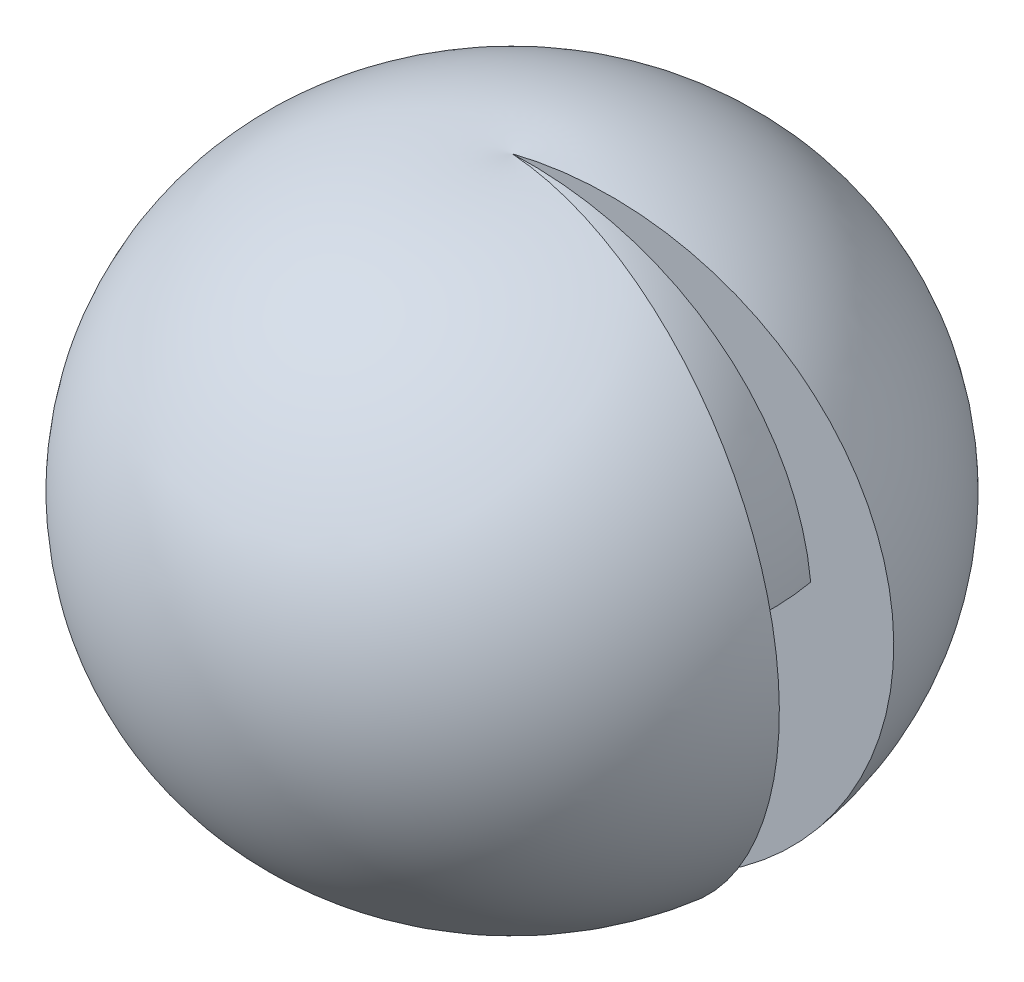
ISO-10303-21;
HEADER;
FILE_DESCRIPTION(('STEP AP214'),'2;1');
FILE_NAME('part.step','',(''),(''),'','','');
FILE_SCHEMA(('AUTOMOTIVE_DESIGN { 1 0 10303 214 1 1 1 1 }'));
ENDSEC;
DATA;
#1=APPLICATION_CONTEXT('core data for automotive mechanical design processes');
#2=APPLICATION_PROTOCOL_DEFINITION('international standard','automotive_design',2000,#1);
#3=PRODUCT_CONTEXT('',#1,'mechanical');
#4=PRODUCT('Part','Part','',(#3));
#5=PRODUCT_RELATED_PRODUCT_CATEGORY('part','',(#4));
#6=PRODUCT_DEFINITION_FORMATION('','',#4);
#7=PRODUCT_DEFINITION_CONTEXT('part definition',#1,'design');
#8=PRODUCT_DEFINITION('design','',#6,#7);
#9=PRODUCT_DEFINITION_SHAPE('','',#8);
#10=(LENGTH_UNIT() NAMED_UNIT(*) SI_UNIT(.MILLI.,.METRE.));
#11=(NAMED_UNIT(*) PLANE_ANGLE_UNIT() SI_UNIT($,.RADIAN.));
#12=(NAMED_UNIT(*) SI_UNIT($,.STERADIAN.) SOLID_ANGLE_UNIT());
#13=UNCERTAINTY_MEASURE_WITH_UNIT(LENGTH_MEASURE(1.E-05),#10,'distance_accuracy_value','');
#14=(GEOMETRIC_REPRESENTATION_CONTEXT(3) GLOBAL_UNCERTAINTY_ASSIGNED_CONTEXT((#13)) GLOBAL_UNIT_ASSIGNED_CONTEXT((#10,
#11,#12)) REPRESENTATION_CONTEXT('',''));
#15=CARTESIAN_POINT('',(0.,0.,0.));
#16=DIRECTION('',(0.,0.,1.));
#17=DIRECTION('',(1.,0.,0.));
#18=AXIS2_PLACEMENT_3D('',#15,#16,#17);
#19=CARTESIAN_POINT('',(-390.19905461,331.47750938,0.));
#20=DIRECTION('',(0.,0.,-1.));
#21=DIRECTION('',(1.,0.,0.));
#22=AXIS2_PLACEMENT_3D('',#19,#20,#21);
#23=CIRCLE('',#22,736.40828629);
#24=TRIMMED_CURVE('',#23,(PARAMETER_VALUE(-1.01235162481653)),
(PARAMETER_VALUE(1.01235162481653)),.T.,.PARAMETER.);
#25=CARTESIAN_POINT('',(0.,331.47750938,0.));
#26=DIRECTION('',(0.,-1.,0.));
#27=AXIS1_PLACEMENT('',#25,#26);
#28=SURFACE_OF_REVOLUTION('',#24,#27);
#29=CARTESIAN_POINT('',(0.,308.445164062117,0.));
#30=DIRECTION('',(0.,-1.,0.));
#31=DIRECTION('',(1.,0.,0.));
#32=AXIS2_PLACEMENT_3D('',#29,#30,#31);
#33=CIRCLE('',#32,345.84895685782);
#34=CARTESIAN_POINT('',(340.594734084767,308.445164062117,60.0560411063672));
#35=VERTEX_POINT('',#34);
#36=CARTESIAN_POINT('',(340.594734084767,308.445164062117,-60.0560411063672));
#37=VERTEX_POINT('',#36);
#38=EDGE_CURVE('E99',#35,#37,#33,.T.);
#39=ORIENTED_EDGE('',*,*,#38,.F.);
#40=CARTESIAN_POINT('',(-384.271054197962,331.47750938,-67.7573547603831));
#41=DIRECTION('',(-0.173648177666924,0.,0.984807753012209));
#42=DIRECTION('',(-0.984807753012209,0.,-0.173648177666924));
#43=AXIS2_PLACEMENT_3D('',#40,#41,#42);
#44=CIRCLE('',#43,736.40828629);
#45=CARTESIAN_POINT('',(-5.97410629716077E-11,-293.055805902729,-5.21695256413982E-12));
#46=VERTEX_POINT('',#45);
#47=EDGE_CURVE('E85',#46,#35,#44,.T.);
#48=ORIENTED_EDGE('',*,*,#47,.F.);
#49=CARTESIAN_POINT('',(-384.271054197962,331.47750938,67.7573547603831));
#50=DIRECTION('',(0.173648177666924,0.,0.984807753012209));
#51=DIRECTION('',(-0.984807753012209,0.,0.173648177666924));
#52=AXIS2_PLACEMENT_3D('',#49,#50,#51);
#53=CIRCLE('',#52,736.40828629);
#54=EDGE_CURVE('E91',#46,#37,#53,.T.);
#55=ORIENTED_EDGE('',*,*,#54,.T.);
#56=EDGE_LOOP('',(#39,#48,#55));
#57=FACE_BOUND('',#56,.T.);
#58=ADVANCED_FACE('F15',(#57),#28,.F.);
#59=CARTESIAN_POINT('',(0.,450.,0.));
#60=DIRECTION('',(0.,-1.,0.));
#61=DIRECTION('',(1.,0.,0.));
#62=AXIS2_PLACEMENT_3D('',#59,#60,#61);
#63=DEGENERATE_TOROIDAL_SURFACE('',#62,150.,241.64971649,.T.);
#64=CARTESIAN_POINT('',(0.,687.323093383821,0.));
#65=DIRECTION('',(0.,-1.,0.));
#66=DIRECTION('',(1.,0.,0.));
#67=AXIS2_PLACEMENT_3D('',#64,#65,#66);
#68=CIRCLE('',#67,195.522904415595);
#69=CARTESIAN_POINT('',(192.552472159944,687.323093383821,33.9521960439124));
#70=VERTEX_POINT('',#69);
#71=CARTESIAN_POINT('',(192.552472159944,687.323093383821,-33.9521960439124));
#72=VERTEX_POINT('',#71);
#73=EDGE_CURVE('E119',#70,#72,#68,.T.);
#74=ORIENTED_EDGE('',*,*,#73,.F.);
#75=CARTESIAN_POINT('',(147.721162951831,450.,26.0472266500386));
#76=DIRECTION('',(-0.173648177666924,0.,0.984807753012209));
#77=DIRECTION('',(0.984807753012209,0.,0.173648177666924));
#78=AXIS2_PLACEMENT_3D('',#75,#76,#77);
#79=CIRCLE('',#78,241.64971649);
#80=EDGE_CURVE('E100',#35,#70,#79,.T.);
#81=ORIENTED_EDGE('',*,*,#80,.F.);
#82=ORIENTED_EDGE('',*,*,#38,.T.);
#83=CARTESIAN_POINT('',(147.721162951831,450.,-26.0472266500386));
#84=DIRECTION('',(0.173648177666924,0.,0.984807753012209));
#85=DIRECTION('',(0.984807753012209,0.,-0.173648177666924));
#86=AXIS2_PLACEMENT_3D('',#83,#84,#85);
#87=CIRCLE('',#86,241.64971649);
#88=EDGE_CURVE('E95',#37,#72,#87,.T.);
#89=ORIENTED_EDGE('',*,*,#88,.T.);
#90=EDGE_LOOP('',(#74,#81,#82,#89));
#91=FACE_BOUND('',#90,.T.);
#92=ADVANCED_FACE('F17',(#91),#63,.F.);
#93=CARTESIAN_POINT('',(-437.75487187,501.42188827,0.));
#94=DIRECTION('',(0.,0.,-1.));
#95=DIRECTION('',(1.,0.,0.));
#96=AXIS2_PLACEMENT_3D('',#93,#94,#95);
#97=CIRCLE('',#96,660.);
#98=TRIMMED_CURVE('',#97,(PARAMETER_VALUE(-0.845623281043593)),
(PARAMETER_VALUE(0.845623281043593)),.T.,.PARAMETER.);
#99=CARTESIAN_POINT('',(0.,501.42188827,0.));
#100=DIRECTION('',(0.,-1.,0.));
#101=AXIS1_PLACEMENT('',#99,#100);
#102=SURFACE_OF_REVOLUTION('',#98,#101);
#103=CARTESIAN_POINT('',(-431.104391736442,501.42188827,76.0153357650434));
#104=DIRECTION('',(0.173648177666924,0.,0.984807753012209));
#105=DIRECTION('',(0.984807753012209,0.,-0.173648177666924));
#106=AXIS2_PLACEMENT_3D('',#103,#104,#105);
#107=CIRCLE('',#106,660.);
#108=CARTESIAN_POINT('',(1.02418074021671E-10,995.355762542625,0.));
#109=VERTEX_POINT('',#108);
#110=EDGE_CURVE('E139',#72,#109,#107,.T.);
#111=ORIENTED_EDGE('',*,*,#110,.T.);
#112=CARTESIAN_POINT('',(-431.104391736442,501.42188827,-76.0153357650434));
#113=DIRECTION('',(-0.173648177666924,0.,0.984807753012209));
#114=DIRECTION('',(0.984807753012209,0.,0.173648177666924));
#115=AXIS2_PLACEMENT_3D('',#112,#113,#114);
#116=CIRCLE('',#115,660.);
#117=EDGE_CURVE('E103',#70,#109,#116,.T.);
#118=ORIENTED_EDGE('',*,*,#117,.F.);
#119=ORIENTED_EDGE('',*,*,#73,.T.);
#120=EDGE_LOOP('',(#111,#118,#119));
#121=FACE_BOUND('',#120,.T.);
#122=ADVANCED_FACE('F165',(#121),#102,.F.);
#123=CARTESIAN_POINT('',(150.,450.,0.));
#124=DIRECTION('',(0.,0.,-1.));
#125=DIRECTION('',(1.,0.,0.));
#126=AXIS2_PLACEMENT_3D('',#123,#124,#125);
#127=CIRCLE('',#126,1250.);
#128=TRIMMED_CURVE('',#127,(PARAMETER_VALUE(-1.69108620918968)),
(PARAMETER_VALUE(1.69108620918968)),.T.,.PARAMETER.);
#129=CARTESIAN_POINT('',(0.,450.,0.));
#130=DIRECTION('',(0.,-1.,0.));
#131=AXIS1_PLACEMENT('',#129,#130);
#132=SURFACE_OF_REVOLUTION('',#128,#131);
#133=CARTESIAN_POINT('',(0.,-682.88473378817,0.));
#134=DIRECTION('',(0.,-1.,0.));
#135=DIRECTION('',(1.,0.,0.));
#136=AXIS2_PLACEMENT_3D('',#133,#134,#135);
#137=CIRCLE('',#136,678.272827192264);
#138=CARTESIAN_POINT('',(667.968338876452,-682.88473378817,117.780840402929));
#139=VERTEX_POINT('',#138);
#140=CARTESIAN_POINT('',(667.968338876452,-682.88473378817,-117.780840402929));
#141=VERTEX_POINT('',#140);
#142=EDGE_CURVE('E117',#139,#141,#137,.T.);
#143=ORIENTED_EDGE('',*,*,#142,.F.);
#144=CARTESIAN_POINT('',(147.721162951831,450.,26.0472266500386));
#145=DIRECTION('',(0.173648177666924,0.,-0.984807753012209));
#146=DIRECTION('',(0.984807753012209,0.,0.173648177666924));
#147=AXIS2_PLACEMENT_3D('',#144,#145,#146);
#148=CIRCLE('',#147,1250.);
#149=CARTESIAN_POINT('',(3.51002140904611E-10,1690.96736459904,3.12113659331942E-11));
#150=VERTEX_POINT('',#149);
#151=EDGE_CURVE('E112',#150,#139,#148,.T.);
#152=ORIENTED_EDGE('',*,*,#151,.F.);
#153=CARTESIAN_POINT('',(147.721162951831,450.,-26.0472266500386));
#154=DIRECTION('',(-0.173648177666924,0.,-0.984807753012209));
#155=DIRECTION('',(0.984807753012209,0.,-0.173648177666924));
#156=AXIS2_PLACEMENT_3D('',#153,#154,#155);
#157=CIRCLE('',#156,1250.);
#158=EDGE_CURVE('E106',#150,#141,#157,.T.);
#159=ORIENTED_EDGE('',*,*,#158,.T.);
#160=EDGE_LOOP('',(#143,#152,#159));
#161=FACE_BOUND('',#160,.T.);
#162=ADVANCED_FACE('F138',(#161),#132,.T.);
#163=CARTESIAN_POINT('',(399.344774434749,-84.7215943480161,0.));
#164=DIRECTION('',(0.,0.,-1.));
#165=DIRECTION('',(1.,0.,0.));
#166=AXIS2_PLACEMENT_3D('',#163,#164,#165);
#167=CIRCLE('',#166,660.);
#168=TRIMMED_CURVE('',#167,(PARAMETER_VALUE(-2.22064739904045)),
(PARAMETER_VALUE(2.22064739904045)),.T.,.PARAMETER.);
#169=CARTESIAN_POINT('',(0.,-84.7215943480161,0.));
#170=DIRECTION('',(0.,-1.,0.));
#171=AXIS1_PLACEMENT('',#169,#170);
#172=SURFACE_OF_REVOLUTION('',#168,#171);
#173=CARTESIAN_POINT('',(393.277829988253,-84.7215943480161,-69.345492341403));
#174=DIRECTION('',(-0.173648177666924,0.,-0.984807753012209));
#175=DIRECTION('',(0.984807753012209,0.,-0.173648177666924));
#176=AXIS2_PLACEMENT_3D('',#173,#174,#175);
#177=CIRCLE('',#176,660.);
#178=CARTESIAN_POINT('',(0.,-610.196380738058,0.));
#179=VERTEX_POINT('',#178);
#180=EDGE_CURVE('E101',#141,#179,#177,.T.);
#181=ORIENTED_EDGE('',*,*,#180,.T.);
#182=CARTESIAN_POINT('',(393.277829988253,-84.7215943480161,69.345492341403));
#183=DIRECTION('',(0.173648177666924,0.,-0.984807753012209));
#184=DIRECTION('',(0.984807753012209,0.,0.173648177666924));
#185=AXIS2_PLACEMENT_3D('',#182,#183,#184);
#186=CIRCLE('',#185,660.);
#187=EDGE_CURVE('E115',#139,#179,#186,.T.);
#188=ORIENTED_EDGE('',*,*,#187,.F.);
#189=ORIENTED_EDGE('',*,*,#142,.T.);
#190=EDGE_LOOP('',(#181,#188,#189));
#191=FACE_BOUND('',#190,.T.);
#192=ADVANCED_FACE('F131',(#191),#172,.T.);
#193=CARTESIAN_POINT('',(-384.271054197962,331.47750938,-67.7573547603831));
#194=DIRECTION('',(0.173648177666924,0.,-0.984807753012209));
#195=DIRECTION('',(-0.984807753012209,0.,-0.173648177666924));
#196=AXIS2_PLACEMENT_3D('',#193,#194,#195);
#197=PLANE('',#196);
#198=CARTESIAN_POINT('',(384.271054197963,331.47750938,67.7573547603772));
#199=DIRECTION('',(0.173648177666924,0.,-0.984807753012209));
#200=DIRECTION('',(-0.984807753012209,0.,-0.173648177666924));
#201=AXIS2_PLACEMENT_3D('',#198,#199,#200);
#202=CIRCLE('',#201,736.40828629);
#203=CARTESIAN_POINT('',(189.113306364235,-377.766074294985,33.3457783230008));
#204=VERTEX_POINT('',#203);
#205=EDGE_CURVE('E76',#46,#204,#202,.F.);
#206=ORIENTED_EDGE('',*,*,#205,.F.);
#207=ORIENTED_EDGE('',*,*,#47,.T.);
#208=ORIENTED_EDGE('',*,*,#80,.T.);
#209=ORIENTED_EDGE('',*,*,#117,.T.);
#210=CARTESIAN_POINT('',(431.104391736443,501.421888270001,76.0153357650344));
#211=DIRECTION('',(0.173648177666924,0.,-0.984807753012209));
#212=DIRECTION('',(-0.984807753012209,0.,-0.173648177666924));
#213=AXIS2_PLACEMENT_3D('',#210,#211,#212);
#214=CIRCLE('',#213,659.999999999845);
#215=CARTESIAN_POINT('',(1078.60416477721,558.944678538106,190.187015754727));
#216=VERTEX_POINT('',#215);
#217=EDGE_CURVE('E97',#216,#109,#214,.F.);
#218=ORIENTED_EDGE('',*,*,#217,.F.);
#219=CARTESIAN_POINT('',(-147.721162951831,450.,-26.0472266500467));
#220=DIRECTION('',(0.173648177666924,0.,-0.984807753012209));
#221=DIRECTION('',(-0.984807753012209,0.,-0.173648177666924));
#222=AXIS2_PLACEMENT_3D('',#219,#220,#221);
#223=CIRCLE('',#222,1249.99999999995);
#224=EDGE_CURVE('E136',#150,#216,#223,.T.);
#225=ORIENTED_EDGE('',*,*,#224,.F.);
#226=ORIENTED_EDGE('',*,*,#151,.T.);
#227=ORIENTED_EDGE('',*,*,#187,.T.);
#228=CARTESIAN_POINT('',(-393.277829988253,-84.7215943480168,-69.3454923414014));
#229=DIRECTION('',(0.173648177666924,0.,-0.984807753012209));
#230=DIRECTION('',(-0.984807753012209,0.,-0.173648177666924));
#231=AXIS2_PLACEMENT_3D('',#228,#229,#230);
#232=CIRCLE('',#231,660.);
#233=EDGE_CURVE('E38',#204,#179,#232,.T.);
#234=ORIENTED_EDGE('',*,*,#233,.F.);
#235=EDGE_LOOP('',(#206,#207,#208,#209,#218,#225,#226,#227,#234));
#236=FACE_BOUND('',#235,.T.);
#237=ADVANCED_FACE('F82',(#236),#197,.T.);
#238=CARTESIAN_POINT('',(-384.271054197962,331.47750938,67.7573547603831));
#239=DIRECTION('',(-0.173648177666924,0.,-0.984807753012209));
#240=DIRECTION('',(-0.984807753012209,0.,0.173648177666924));
#241=AXIS2_PLACEMENT_3D('',#238,#239,#240);
#242=PLANE('',#241);
#243=ORIENTED_EDGE('',*,*,#54,.F.);
#244=CARTESIAN_POINT('',(384.271054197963,331.47750938,-67.7573547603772));
#245=DIRECTION('',(-0.173648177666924,0.,-0.984807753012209));
#246=DIRECTION('',(-0.984807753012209,0.,0.173648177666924));
#247=AXIS2_PLACEMENT_3D('',#244,#245,#246);
#248=CIRCLE('',#247,736.40828629);
#249=CARTESIAN_POINT('',(189.113306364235,-377.766074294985,-33.3457783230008));
#250=VERTEX_POINT('',#249);
#251=EDGE_CURVE('E10',#46,#250,#248,.F.);
#252=ORIENTED_EDGE('',*,*,#251,.T.);
#253=CARTESIAN_POINT('',(-393.277829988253,-84.7215943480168,69.3454923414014));
#254=DIRECTION('',(-0.173648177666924,0.,-0.984807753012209));
#255=DIRECTION('',(-0.984807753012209,0.,0.173648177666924));
#256=AXIS2_PLACEMENT_3D('',#253,#254,#255);
#257=CIRCLE('',#256,660.);
#258=EDGE_CURVE('E23',#250,#179,#257,.T.);
#259=ORIENTED_EDGE('',*,*,#258,.T.);
#260=ORIENTED_EDGE('',*,*,#180,.F.);
#261=ORIENTED_EDGE('',*,*,#158,.F.);
#262=CARTESIAN_POINT('',(-147.721162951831,450.,26.0472266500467));
#263=DIRECTION('',(-0.173648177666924,0.,-0.984807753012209));
#264=DIRECTION('',(-0.984807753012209,0.,0.173648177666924));
#265=AXIS2_PLACEMENT_3D('',#262,#263,#264);
#266=CIRCLE('',#265,1249.99999999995);
#267=CARTESIAN_POINT('',(1078.60416477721,558.944678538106,-190.187015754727));
#268=VERTEX_POINT('',#267);
#269=EDGE_CURVE('E122',#150,#268,#266,.T.);
#270=ORIENTED_EDGE('',*,*,#269,.T.);
#271=CARTESIAN_POINT('',(431.104391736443,501.421888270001,-76.0153357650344));
#272=DIRECTION('',(-0.173648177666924,0.,-0.984807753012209));
#273=DIRECTION('',(-0.984807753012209,0.,0.173648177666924));
#274=AXIS2_PLACEMENT_3D('',#271,#272,#273);
#275=CIRCLE('',#274,659.999999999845);
#276=EDGE_CURVE('E125',#268,#109,#275,.F.);
#277=ORIENTED_EDGE('',*,*,#276,.T.);
#278=ORIENTED_EDGE('',*,*,#110,.F.);
#279=ORIENTED_EDGE('',*,*,#88,.F.);
#280=EDGE_LOOP('',(#243,#252,#259,#260,#261,#270,#277,#278,#279));
#281=FACE_BOUND('',#280,.T.);
#282=ADVANCED_FACE('F92',(#281),#242,.F.);
#283=CARTESIAN_POINT('',(437.75487187,501.42188827,0.));
#284=DIRECTION('',(0.,0.,-1.));
#285=DIRECTION('',(1.,-1.02895947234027E-13,0.));
#286=AXIS2_PLACEMENT_3D('',#283,#284,#285);
#287=CIRCLE('',#286,659.999999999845);
#288=TRIMMED_CURVE('',#287,(PARAMETER_VALUE(-2.2959693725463)),
(PARAMETER_VALUE(2.2959693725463)),.T.,.PARAMETER.);
#289=CARTESIAN_POINT('',(5.15698594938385E-11,501.421888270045,0.));
#290=DIRECTION('',(-1.02895947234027E-13,-1.,0.));
#291=AXIS1_PLACEMENT('',#289,#290);
#292=SURFACE_OF_REVOLUTION('',#288,#291);
#293=CARTESIAN_POINT('',(5.75131421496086E-11,558.944678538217,0.));
#294=DIRECTION('',(-1.02895947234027E-13,-1.,0.));
#295=DIRECTION('',(1.,-1.02895947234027E-13,0.));
#296=AXIS2_PLACEMENT_3D('',#293,#294,#295);
#297=CIRCLE('',#296,1095.24337260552);
#298=EDGE_CURVE('E30',#268,#216,#297,.T.);
#299=ORIENTED_EDGE('',*,*,#298,.T.);
#300=ORIENTED_EDGE('',*,*,#217,.T.);
#301=ORIENTED_EDGE('',*,*,#276,.F.);
#302=EDGE_LOOP('',(#299,#300,#301));
#303=FACE_BOUND('',#302,.T.);
#304=ADVANCED_FACE('F180',(#303),#292,.F.);
#305=CARTESIAN_POINT('',(-150.,450.,0.));
#306=DIRECTION('',(0.,0.,-1.));
#307=DIRECTION('',(1.,-1.02895947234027E-13,0.));
#308=AXIS2_PLACEMENT_3D('',#305,#306,#307);
#309=CIRCLE('',#308,1249.99999999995);
#310=TRIMMED_CURVE('',#309,(PARAMETER_VALUE(-1.45050644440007)),
(PARAMETER_VALUE(1.45050644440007)),.T.,.PARAMETER.);
#311=CARTESIAN_POINT('',(4.6296300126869E-11,449.999999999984,0.));
#312=DIRECTION('',(-1.02895947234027E-13,-1.,0.));
#313=AXIS1_PLACEMENT('',#311,#312);
#314=SURFACE_OF_REVOLUTION('',#310,#313);
#315=ORIENTED_EDGE('',*,*,#269,.F.);
#316=ORIENTED_EDGE('',*,*,#224,.T.);
#317=ORIENTED_EDGE('',*,*,#298,.F.);
#318=EDGE_LOOP('',(#315,#316,#317));
#319=FACE_BOUND('',#318,.T.);
#320=ADVANCED_FACE('F156',(#319),#314,.T.);
#321=CARTESIAN_POINT('',(390.19905461,331.47750938,0.));
#322=DIRECTION('',(0.,0.,-1.));
#323=DIRECTION('',(1.,-1.02895947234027E-13,0.));
#324=AXIS2_PLACEMENT_3D('',#321,#322,#323);
#325=CIRCLE('',#324,736.40828629);
#326=TRIMMED_CURVE('',#325,(PARAMETER_VALUE(-2.12924102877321)),
(PARAMETER_VALUE(2.12924102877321)),.T.,.PARAMETER.);
#327=CARTESIAN_POINT('',(3.40838468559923E-11,331.47750938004,0.));
#328=DIRECTION('',(-1.02895947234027E-13,-1.,0.));
#329=AXIS1_PLACEMENT('',#327,#328);
#330=SURFACE_OF_REVOLUTION('',#326,#329);
#331=ORIENTED_EDGE('',*,*,#251,.F.);
#332=ORIENTED_EDGE('',*,*,#205,.T.);
#333=CARTESIAN_POINT('',(-3.88705980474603E-11,-377.766074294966,0.));
#334=DIRECTION('',(-1.02895947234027E-13,-1.,0.));
#335=DIRECTION('',(1.,-1.02895947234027E-13,0.));
#336=AXIS2_PLACEMENT_3D('',#333,#334,#335);
#337=CIRCLE('',#336,192.030683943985);
#338=EDGE_CURVE('E77',#250,#204,#337,.T.);
#339=ORIENTED_EDGE('',*,*,#338,.F.);
#340=EDGE_LOOP('',(#331,#332,#339));
#341=FACE_BOUND('',#340,.T.);
#342=ADVANCED_FACE('F75',(#341),#330,.F.);
#343=CARTESIAN_POINT('',(-399.344774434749,-84.7215943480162,0.));
#344=DIRECTION('',(0.,0.,-1.));
#345=DIRECTION('',(1.,-1.02895947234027E-13,0.));
#346=AXIS2_PLACEMENT_3D('',#343,#344,#345);
#347=CIRCLE('',#346,660.);
#348=TRIMMED_CURVE('',#347,(PARAMETER_VALUE(-0.92094525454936)),
(PARAMETER_VALUE(0.92094525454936)),.T.,.PARAMETER.);
#349=CARTESIAN_POINT('',(-8.71525074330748E-12,-84.7215943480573,0.));
#350=DIRECTION('',(-1.02895947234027E-13,-1.,0.));
#351=AXIS1_PLACEMENT('',#349,#350);
#352=SURFACE_OF_REVOLUTION('',#348,#351);
#353=ORIENTED_EDGE('',*,*,#338,.T.);
#354=ORIENTED_EDGE('',*,*,#233,.T.);
#355=ORIENTED_EDGE('',*,*,#258,.F.);
#356=EDGE_LOOP('',(#353,#354,#355));
#357=FACE_BOUND('',#356,.T.);
#358=ADVANCED_FACE('F148',(#357),#352,.T.);
#359=CLOSED_SHELL('',(#58,#92,#122,#162,#192,#237,#282,#304,#320,#342,#358));
#360=MANIFOLD_SOLID_BREP('B1',#359);
#361=ADVANCED_BREP_SHAPE_REPRESENTATION('',(#18,#360),#14);
#362=SHAPE_DEFINITION_REPRESENTATION(#9,#361);
ENDSEC;
END-ISO-10303-21;
